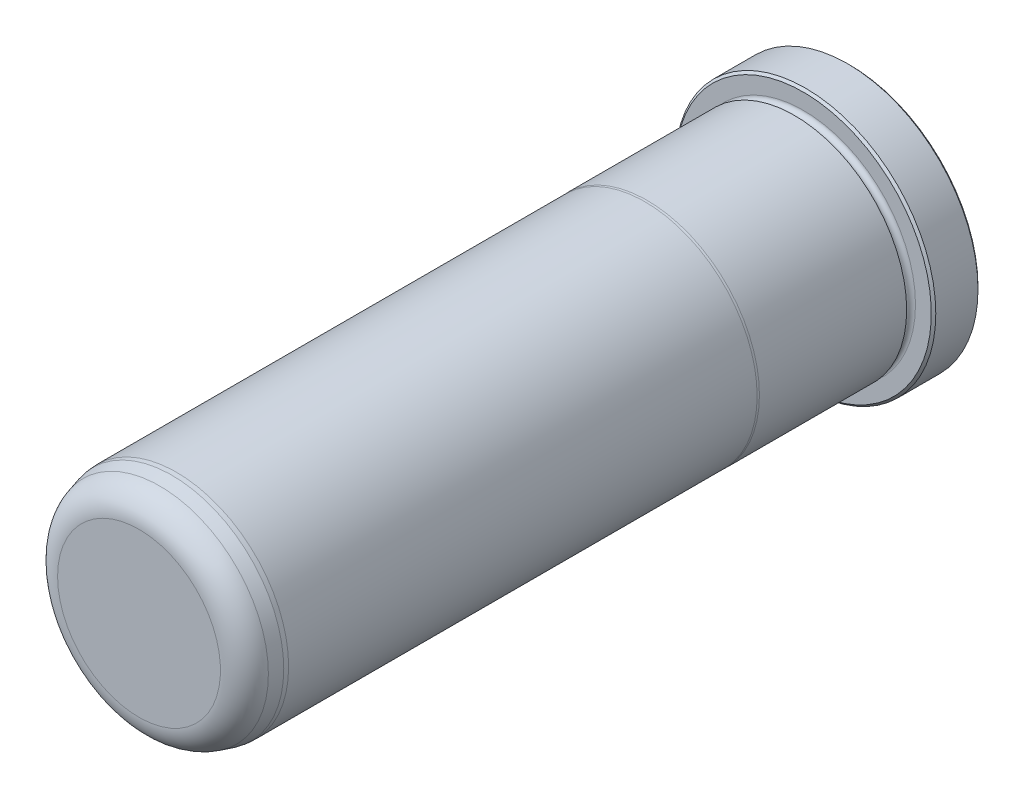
from build123d import *

# Parameters (mm, degrees)
FILLET6_R     = 4.7625
CHAMFER1_SIZE = 0.381


with BuildPart() as part:
    # Sketch1 → Revolve1 (revolve)
    with BuildSketch(Plane(origin=(0, 0, 0), x_dir=(0, 0, -1), z_dir=(1, 0, 0)), mode=Mode.PRIVATE) as revolve1_sk:
        with BuildLine():
            Line((0, 0), (0, 22.098))
            Line((0, 22.098), (-7.9248, 22.098))
            Line((-7.9248, 22.098), (-7.9248, 19.0373))
            ThreePointArc((-7.9248, 19.0373), (-8.6868, 18.2753), (-9.4488, 19.0373))
            Line((-9.4488, 19.0373), (-9.4488, 19.0627))
            Line((-9.4488, 19.0627), (-34.434763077, 19.0627))
            Line((-34.434763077, 19.0627), (-34.798, 19.0373))
            Line((-34.798, 19.0373), (-114.3, 19.0373))
            Line((-114.3, 19.0373), (-115.062, 18.970633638))
            Line((-115.062, 18.970633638), (-120.65, 17.473333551))
            Line((-120.65, 17.473333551), (-120.65, 0))
            Line((-120.65, 0), (0, 0))
        make_face()
    revolve(revolve1_sk.sketch.rotate(Axis((0, 0, 0), (0, 0, -1)), 90), axis=Axis((0, 0, 0), (0, 0, -1)))

    # Fillet6
    fillet6_edges = [part.edges().sort_by_distance(p)[0] for p in [
        (-17.473333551, 0, 120.65),
    ]]
    fillet(fillet6_edges, radius=FILLET6_R)

    # Chamfer1
    chamfer1_edges = [part.edges().sort_by_distance(p)[0] for p in [
        (-22.098, 0, 7.9248),
        (-22.098, 0, 0),
    ]]
    chamfer(chamfer1_edges, length=CHAMFER1_SIZE)


solid = part.part
